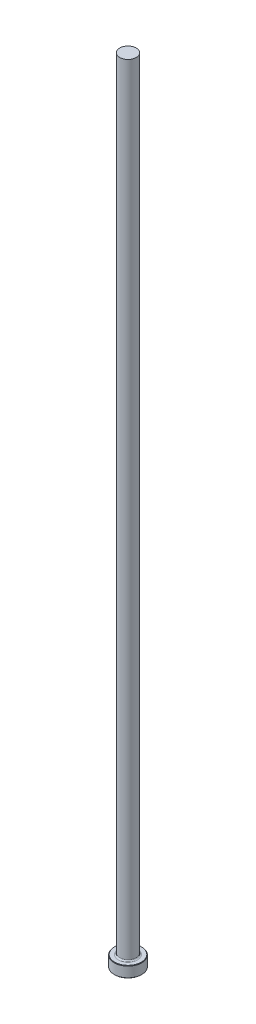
from build123d import *

# Parameters (mm, degrees)
CHAMFER1_SIZE = 0.254
FILLET1_R     = 0.762


with BuildPart() as part:
    # Sketch1 → Revolve1 (revolve)
    with BuildSketch(Plane.XY, mode=Mode.PRIVATE) as revolve1_sk:
        Polygon((0, 0), (-7.9375, 0), (-7.9375, 6.35), (-4.7625, 6.35), (-4.7625, 457.2), (0, 457.2), align=None)
    revolve(revolve1_sk.sketch.rotate(Axis((0, 259.958771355, 0), (0, -1, 0)), 270), axis=Axis((0, 259.958771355, 0), (0, -1, 0)))

    # Chamfer1
    chamfer1_edges = [part.edges().sort_by_distance(p)[0] for p in [
        (0, 6.35, -7.9375),
        (0, 0, -7.9375),
    ]]
    chamfer(chamfer1_edges, length=CHAMFER1_SIZE)

    # Fillet1
    fillet1_edges = [part.edges().sort_by_distance(p)[0] for p in [
        (0, 6.35, -4.7625),
    ]]
    fillet(fillet1_edges, radius=FILLET1_R)


solid = part.part
